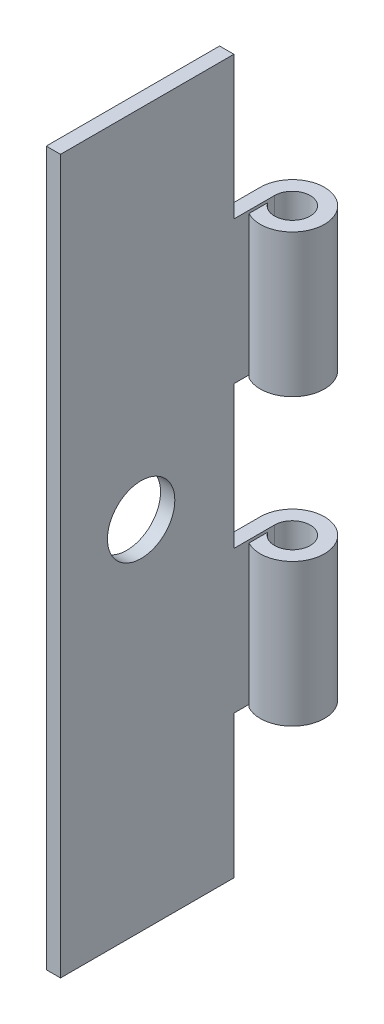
ISO-10303-21;
HEADER;
FILE_DESCRIPTION(('STEP AP214'),'2;1');
FILE_NAME('part.step','',(''),(''),'','','');
FILE_SCHEMA(('AUTOMOTIVE_DESIGN { 1 0 10303 214 1 1 1 1 }'));
ENDSEC;
DATA;
#1=APPLICATION_CONTEXT('core data for automotive mechanical design processes');
#2=APPLICATION_PROTOCOL_DEFINITION('international standard','automotive_design',2000,#1);
#3=PRODUCT_CONTEXT('',#1,'mechanical');
#4=PRODUCT('Part','Part','',(#3));
#5=PRODUCT_RELATED_PRODUCT_CATEGORY('part','',(#4));
#6=PRODUCT_DEFINITION_FORMATION('','',#4);
#7=PRODUCT_DEFINITION_CONTEXT('part definition',#1,'design');
#8=PRODUCT_DEFINITION('design','',#6,#7);
#9=PRODUCT_DEFINITION_SHAPE('','',#8);
#10=(LENGTH_UNIT() NAMED_UNIT(*) SI_UNIT(.MILLI.,.METRE.));
#11=(NAMED_UNIT(*) PLANE_ANGLE_UNIT() SI_UNIT($,.RADIAN.));
#12=(NAMED_UNIT(*) SI_UNIT($,.STERADIAN.) SOLID_ANGLE_UNIT());
#13=UNCERTAINTY_MEASURE_WITH_UNIT(LENGTH_MEASURE(1.E-05),#10,'distance_accuracy_value','');
#14=(GEOMETRIC_REPRESENTATION_CONTEXT(3) GLOBAL_UNCERTAINTY_ASSIGNED_CONTEXT((#13)) GLOBAL_UNIT_ASSIGNED_CONTEXT((#10,
#11,#12)) REPRESENTATION_CONTEXT('',''));
#15=CARTESIAN_POINT('',(0.,0.,0.));
#16=DIRECTION('',(0.,0.,1.));
#17=DIRECTION('',(1.,0.,0.));
#18=AXIS2_PLACEMENT_3D('',#15,#16,#17);
#19=CARTESIAN_POINT('',(1.42875,31.75,0.));
#20=DIRECTION('',(0.,-1.,0.));
#21=DIRECTION('',(0.,0.,-1.));
#22=AXIS2_PLACEMENT_3D('',#19,#20,#21);
#23=CYLINDRICAL_SURFACE('',#22,1.42875);
#24=DIRECTION('',(0.,-1.,0.));
#25=VECTOR('',#24,1.);
#26=CARTESIAN_POINT('',(0.762000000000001,31.75,1.26363404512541));
#27=LINE('',#26,#25);
#28=CARTESIAN_POINT('',(0.762000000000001,12.7,1.26363404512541));
#29=VERTEX_POINT('',#28);
#30=CARTESIAN_POINT('',(0.762000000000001,6.35,1.26363404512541));
#31=VERTEX_POINT('',#30);
#32=EDGE_CURVE('E199',#29,#31,#27,.T.);
#33=ORIENTED_EDGE('',*,*,#32,.T.);
#34=CARTESIAN_POINT('',(1.42875,6.35,0.));
#35=DIRECTION('',(0.,-1.,0.));
#36=DIRECTION('',(0.,0.,-1.));
#37=AXIS2_PLACEMENT_3D('',#34,#35,#36);
#38=CIRCLE('',#37,1.42875);
#39=CARTESIAN_POINT('',(0.,6.35,0.));
#40=VERTEX_POINT('',#39);
#41=EDGE_CURVE('E187',#40,#31,#38,.T.);
#42=ORIENTED_EDGE('',*,*,#41,.F.);
#43=DIRECTION('',(0.,-1.,0.));
#44=VECTOR('',#43,1.);
#45=CARTESIAN_POINT('',(0.,31.75,0.));
#46=LINE('',#45,#44);
#47=CARTESIAN_POINT('',(0.,12.7,0.));
#48=VERTEX_POINT('',#47);
#49=EDGE_CURVE('E216',#48,#40,#46,.T.);
#50=ORIENTED_EDGE('',*,*,#49,.F.);
#51=CARTESIAN_POINT('',(1.42875,12.7,0.));
#52=DIRECTION('',(0.,1.,0.));
#53=DIRECTION('',(0.,0.,1.));
#54=AXIS2_PLACEMENT_3D('',#51,#52,#53);
#55=CIRCLE('',#54,1.42875);
#56=EDGE_CURVE('E247',#29,#48,#55,.T.);
#57=ORIENTED_EDGE('',*,*,#56,.F.);
#58=EDGE_LOOP('',(#33,#42,#50,#57));
#59=FACE_BOUND('',#58,.T.);
#60=ADVANCED_FACE('F49',(#59),#23,.T.);
#61=CARTESIAN_POINT('',(1.42875,25.4,0.));
#62=DIRECTION('',(0.,1.,0.));
#63=DIRECTION('',(0.,0.,1.));
#64=AXIS2_PLACEMENT_3D('',#61,#62,#63);
#65=CIRCLE('',#64,1.42875);
#66=CARTESIAN_POINT('',(0.762000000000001,25.4,1.26363404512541));
#67=VERTEX_POINT('',#66);
#68=CARTESIAN_POINT('',(0.,25.4,0.));
#69=VERTEX_POINT('',#68);
#70=EDGE_CURVE('E240',#67,#69,#65,.T.);
#71=ORIENTED_EDGE('',*,*,#70,.F.);
#72=CARTESIAN_POINT('',(0.762000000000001,19.05,1.26363404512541));
#73=VERTEX_POINT('',#72);
#74=EDGE_CURVE('E202',#67,#73,#27,.T.);
#75=ORIENTED_EDGE('',*,*,#74,.T.);
#76=CARTESIAN_POINT('',(1.42875,19.05,0.));
#77=DIRECTION('',(0.,-1.,0.));
#78=DIRECTION('',(0.,0.,-1.));
#79=AXIS2_PLACEMENT_3D('',#76,#77,#78);
#80=CIRCLE('',#79,1.42875);
#81=CARTESIAN_POINT('',(0.,19.05,0.));
#82=VERTEX_POINT('',#81);
#83=EDGE_CURVE('E63',#82,#73,#80,.T.);
#84=ORIENTED_EDGE('',*,*,#83,.F.);
#85=EDGE_CURVE('E173',#69,#82,#46,.T.);
#86=ORIENTED_EDGE('',*,*,#85,.F.);
#87=EDGE_LOOP('',(#71,#75,#84,#86));
#88=FACE_BOUND('',#87,.T.);
#89=ADVANCED_FACE('F320',(#88),#23,.T.);
#90=CARTESIAN_POINT('',(0.,31.75,0.));
#91=DIRECTION('',(1.,0.,0.));
#92=DIRECTION('',(0.,0.,-1.));
#93=AXIS2_PLACEMENT_3D('',#90,#91,#92);
#94=PLANE('',#93);
#95=CARTESIAN_POINT('',(0.,15.875,5.93725));
#96=DIRECTION('',(1.,0.,0.));
#97=DIRECTION('',(0.,0.,-1.));
#98=AXIS2_PLACEMENT_3D('',#95,#96,#97);
#99=CIRCLE('',#98,1.5);
#100=CARTESIAN_POINT('',(0.,15.875,4.43725));
#101=VERTEX_POINT('',#100);
#102=EDGE_CURVE('E313',#101,#101,#99,.T.);
#103=ORIENTED_EDGE('',*,*,#102,.T.);
#104=EDGE_LOOP('',(#103));
#105=FACE_BOUND('',#104,.T.);
#106=DIRECTION('',(0.,-1.,0.));
#107=VECTOR('',#106,1.);
#108=CARTESIAN_POINT('',(0.,6.35,1.80975));
#109=LINE('',#108,#107);
#110=CARTESIAN_POINT('',(0.,6.35,1.80975));
#111=VERTEX_POINT('',#110);
#112=CARTESIAN_POINT('',(0.,0.,1.80975));
#113=VERTEX_POINT('',#112);
#114=EDGE_CURVE('E164',#111,#113,#109,.T.);
#115=ORIENTED_EDGE('',*,*,#114,.T.);
#116=DIRECTION('',(0.,0.,1.));
#117=VECTOR('',#116,1.);
#118=CARTESIAN_POINT('',(0.,0.,0.));
#119=LINE('',#118,#117);
#120=CARTESIAN_POINT('',(0.,0.,9.525));
#121=VERTEX_POINT('',#120);
#122=EDGE_CURVE('E178',#113,#121,#119,.T.);
#123=ORIENTED_EDGE('',*,*,#122,.T.);
#124=DIRECTION('',(0.,-1.,0.));
#125=VECTOR('',#124,1.);
#126=CARTESIAN_POINT('',(0.,31.75,9.525));
#127=LINE('',#126,#125);
#128=CARTESIAN_POINT('',(0.,31.75,9.525));
#129=VERTEX_POINT('',#128);
#130=EDGE_CURVE('E214',#129,#121,#127,.T.);
#131=ORIENTED_EDGE('',*,*,#130,.F.);
#132=DIRECTION('',(0.,0.,1.));
#133=VECTOR('',#132,1.);
#134=CARTESIAN_POINT('',(0.,31.75,0.));
#135=LINE('',#134,#133);
#136=CARTESIAN_POINT('',(0.,31.75,1.80975));
#137=VERTEX_POINT('',#136);
#138=EDGE_CURVE('E198',#137,#129,#135,.T.);
#139=ORIENTED_EDGE('',*,*,#138,.F.);
#140=DIRECTION('',(0.,-1.,0.));
#141=VECTOR('',#140,1.);
#142=CARTESIAN_POINT('',(0.,31.75,1.80975));
#143=LINE('',#142,#141);
#144=CARTESIAN_POINT('',(0.,25.4,1.80975));
#145=VERTEX_POINT('',#144);
#146=EDGE_CURVE('E71',#137,#145,#143,.T.);
#147=ORIENTED_EDGE('',*,*,#146,.T.);
#148=DIRECTION('',(0.,0.,-1.));
#149=VECTOR('',#148,1.);
#150=CARTESIAN_POINT('',(0.,25.4,1.80975));
#151=LINE('',#150,#149);
#152=EDGE_CURVE('E307',#145,#69,#151,.T.);
#153=ORIENTED_EDGE('',*,*,#152,.T.);
#154=ORIENTED_EDGE('',*,*,#85,.T.);
#155=DIRECTION('',(0.,0.,1.));
#156=VECTOR('',#155,1.);
#157=CARTESIAN_POINT('',(0.,19.05,1.80975));
#158=LINE('',#157,#156);
#159=CARTESIAN_POINT('',(0.,19.05,1.80975));
#160=VERTEX_POINT('',#159);
#161=EDGE_CURVE('E301',#82,#160,#158,.T.);
#162=ORIENTED_EDGE('',*,*,#161,.T.);
#163=DIRECTION('',(0.,-1.,0.));
#164=VECTOR('',#163,1.);
#165=CARTESIAN_POINT('',(0.,19.05,1.80975));
#166=LINE('',#165,#164);
#167=CARTESIAN_POINT('',(0.,12.7,1.80975));
#168=VERTEX_POINT('',#167);
#169=EDGE_CURVE('E298',#160,#168,#166,.T.);
#170=ORIENTED_EDGE('',*,*,#169,.T.);
#171=DIRECTION('',(0.,0.,-1.));
#172=VECTOR('',#171,1.);
#173=CARTESIAN_POINT('',(0.,12.7,1.80975));
#174=LINE('',#173,#172);
#175=EDGE_CURVE('E312',#168,#48,#174,.T.);
#176=ORIENTED_EDGE('',*,*,#175,.T.);
#177=ORIENTED_EDGE('',*,*,#49,.T.);
#178=DIRECTION('',(0.,0.,1.));
#179=VECTOR('',#178,1.);
#180=CARTESIAN_POINT('',(0.,6.35,1.80975));
#181=LINE('',#180,#179);
#182=EDGE_CURVE('E181',#40,#111,#181,.T.);
#183=ORIENTED_EDGE('',*,*,#182,.T.);
#184=EDGE_LOOP('',(#115,#123,#131,#139,#147,#153,#154,#162,#170,#176,#177,#183));
#185=FACE_BOUND('',#184,.T.);
#186=ADVANCED_FACE('F176',(#105,#185),#94,.F.);
#187=CARTESIAN_POINT('',(0.635,31.75,9.525));
#188=DIRECTION('',(-1.,0.,0.));
#189=DIRECTION('',(0.,0.,1.));
#190=AXIS2_PLACEMENT_3D('',#187,#188,#189);
#191=PLANE('',#190);
#192=CARTESIAN_POINT('',(0.635,15.875,5.93725));
#193=DIRECTION('',(1.,0.,0.));
#194=DIRECTION('',(0.,0.,-1.));
#195=AXIS2_PLACEMENT_3D('',#192,#193,#194);
#196=CIRCLE('',#195,1.5);
#197=CARTESIAN_POINT('',(0.635,15.875,4.43725));
#198=VERTEX_POINT('',#197);
#199=EDGE_CURVE('E550',#198,#198,#196,.T.);
#200=ORIENTED_EDGE('',*,*,#199,.F.);
#201=EDGE_LOOP('',(#200));
#202=FACE_BOUND('',#201,.T.);
#203=DIRECTION('',(0.,-1.,0.));
#204=VECTOR('',#203,1.);
#205=CARTESIAN_POINT('',(0.635,31.75,1.80974999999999));
#206=LINE('',#205,#204);
#207=CARTESIAN_POINT('',(0.635000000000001,6.35,1.80975));
#208=VERTEX_POINT('',#207);
#209=CARTESIAN_POINT('',(0.635,0.,1.80975));
#210=VERTEX_POINT('',#209);
#211=EDGE_CURVE('E167',#208,#210,#206,.T.);
#212=ORIENTED_EDGE('',*,*,#211,.F.);
#213=DIRECTION('',(0.,0.,1.));
#214=VECTOR('',#213,1.);
#215=CARTESIAN_POINT('',(0.635,6.35,9.525));
#216=LINE('',#215,#214);
#217=CARTESIAN_POINT('',(0.635,6.35,0.));
#218=VERTEX_POINT('',#217);
#219=EDGE_CURVE('E191',#218,#208,#216,.T.);
#220=ORIENTED_EDGE('',*,*,#219,.F.);
#221=DIRECTION('',(0.,-1.,0.));
#222=VECTOR('',#221,1.);
#223=CARTESIAN_POINT('',(0.635,31.75,0.));
#224=LINE('',#223,#222);
#225=CARTESIAN_POINT('',(0.635,12.7,0.));
#226=VERTEX_POINT('',#225);
#227=EDGE_CURVE('E207',#226,#218,#224,.T.);
#228=ORIENTED_EDGE('',*,*,#227,.F.);
#229=DIRECTION('',(0.,0.,-1.));
#230=VECTOR('',#229,1.);
#231=CARTESIAN_POINT('',(0.635,12.7,9.525));
#232=LINE('',#231,#230);
#233=CARTESIAN_POINT('',(0.635000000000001,12.7,1.80975));
#234=VERTEX_POINT('',#233);
#235=EDGE_CURVE('E252',#234,#226,#232,.T.);
#236=ORIENTED_EDGE('',*,*,#235,.F.);
#237=DIRECTION('',(0.,-1.,0.));
#238=VECTOR('',#237,1.);
#239=CARTESIAN_POINT('',(0.635,31.75,1.80975));
#240=LINE('',#239,#238);
#241=CARTESIAN_POINT('',(0.635000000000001,19.05,1.80975));
#242=VERTEX_POINT('',#241);
#243=EDGE_CURVE('E12',#242,#234,#240,.T.);
#244=ORIENTED_EDGE('',*,*,#243,.F.);
#245=DIRECTION('',(0.,0.,1.));
#246=VECTOR('',#245,1.);
#247=CARTESIAN_POINT('',(0.635,19.05,9.525));
#248=LINE('',#247,#246);
#249=CARTESIAN_POINT('',(0.635,19.05,0.));
#250=VERTEX_POINT('',#249);
#251=EDGE_CURVE('E255',#250,#242,#248,.T.);
#252=ORIENTED_EDGE('',*,*,#251,.F.);
#253=CARTESIAN_POINT('',(0.635,25.4,0.));
#254=VERTEX_POINT('',#253);
#255=EDGE_CURVE('E210',#254,#250,#224,.T.);
#256=ORIENTED_EDGE('',*,*,#255,.F.);
#257=DIRECTION('',(0.,0.,-1.));
#258=VECTOR('',#257,1.);
#259=CARTESIAN_POINT('',(0.635,25.4,9.525));
#260=LINE('',#259,#258);
#261=CARTESIAN_POINT('',(0.635000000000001,25.4,1.80975));
#262=VERTEX_POINT('',#261);
#263=EDGE_CURVE('E262',#262,#254,#260,.T.);
#264=ORIENTED_EDGE('',*,*,#263,.F.);
#265=DIRECTION('',(0.,-1.,0.));
#266=VECTOR('',#265,1.);
#267=CARTESIAN_POINT('',(0.635,31.75,1.80975));
#268=LINE('',#267,#266);
#269=CARTESIAN_POINT('',(0.635000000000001,31.75,1.80975));
#270=VERTEX_POINT('',#269);
#271=EDGE_CURVE('E278',#270,#262,#268,.T.);
#272=ORIENTED_EDGE('',*,*,#271,.F.);
#273=DIRECTION('',(0.,0.,-1.));
#274=VECTOR('',#273,1.);
#275=CARTESIAN_POINT('',(0.635,31.75,9.525));
#276=LINE('',#275,#274);
#277=CARTESIAN_POINT('',(0.635,31.75,9.525));
#278=VERTEX_POINT('',#277);
#279=EDGE_CURVE('E194',#278,#270,#276,.T.);
#280=ORIENTED_EDGE('',*,*,#279,.F.);
#281=DIRECTION('',(0.,-1.,0.));
#282=VECTOR('',#281,1.);
#283=CARTESIAN_POINT('',(0.635,31.75,9.525));
#284=LINE('',#283,#282);
#285=CARTESIAN_POINT('',(0.635,0.,9.525));
#286=VERTEX_POINT('',#285);
#287=EDGE_CURVE('E211',#278,#286,#284,.T.);
#288=ORIENTED_EDGE('',*,*,#287,.T.);
#289=DIRECTION('',(0.,0.,-1.));
#290=VECTOR('',#289,1.);
#291=CARTESIAN_POINT('',(0.635,0.,9.525));
#292=LINE('',#291,#290);
#293=EDGE_CURVE('E189',#286,#210,#292,.T.);
#294=ORIENTED_EDGE('',*,*,#293,.T.);
#295=EDGE_LOOP('',(#212,#220,#228,#236,#244,#252,#256,#264,#272,#280,#288,#294));
#296=FACE_BOUND('',#295,.T.);
#297=ADVANCED_FACE('F276',(#202,#296),#191,.F.);
#298=CARTESIAN_POINT('',(1.42875,31.75,0.));
#299=DIRECTION('',(0.,-1.,0.));
#300=DIRECTION('',(0.,0.,-1.));
#301=AXIS2_PLACEMENT_3D('',#298,#299,#300);
#302=CYLINDRICAL_SURFACE('',#301,0.79375);
#303=CARTESIAN_POINT('',(1.42875,6.35,0.));
#304=DIRECTION('',(0.,-1.,0.));
#305=DIRECTION('',(0.,0.,-1.));
#306=AXIS2_PLACEMENT_3D('',#303,#304,#305);
#307=CIRCLE('',#306,0.79375);
#308=CARTESIAN_POINT('',(0.762000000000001,6.35,0.430677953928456));
#309=VERTEX_POINT('',#308);
#310=EDGE_CURVE('E230',#309,#218,#307,.F.);
#311=ORIENTED_EDGE('',*,*,#310,.F.);
#312=DIRECTION('',(0.,-1.,0.));
#313=VECTOR('',#312,1.);
#314=CARTESIAN_POINT('',(0.762000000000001,31.75,0.430677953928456));
#315=LINE('',#314,#313);
#316=CARTESIAN_POINT('',(0.762000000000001,12.7,0.430677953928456));
#317=VERTEX_POINT('',#316);
#318=EDGE_CURVE('E203',#317,#309,#315,.T.);
#319=ORIENTED_EDGE('',*,*,#318,.F.);
#320=CARTESIAN_POINT('',(1.42875,12.7,0.));
#321=DIRECTION('',(0.,1.,0.));
#322=DIRECTION('',(0.,0.,1.));
#323=AXIS2_PLACEMENT_3D('',#320,#321,#322);
#324=CIRCLE('',#323,0.79375);
#325=EDGE_CURVE('E249',#226,#317,#324,.F.);
#326=ORIENTED_EDGE('',*,*,#325,.F.);
#327=ORIENTED_EDGE('',*,*,#227,.T.);
#328=EDGE_LOOP('',(#311,#319,#326,#327));
#329=FACE_BOUND('',#328,.T.);
#330=ADVANCED_FACE('F237',(#329),#302,.F.);
#331=CARTESIAN_POINT('',(1.42875,25.4,0.));
#332=DIRECTION('',(0.,1.,0.));
#333=DIRECTION('',(0.,0.,1.));
#334=AXIS2_PLACEMENT_3D('',#331,#332,#333);
#335=CIRCLE('',#334,0.79375);
#336=CARTESIAN_POINT('',(0.762000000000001,25.4,0.430677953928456));
#337=VERTEX_POINT('',#336);
#338=EDGE_CURVE('E260',#254,#337,#335,.F.);
#339=ORIENTED_EDGE('',*,*,#338,.F.);
#340=ORIENTED_EDGE('',*,*,#255,.T.);
#341=CARTESIAN_POINT('',(1.42875,19.05,0.));
#342=DIRECTION('',(0.,-1.,0.));
#343=DIRECTION('',(0.,0.,-1.));
#344=AXIS2_PLACEMENT_3D('',#341,#342,#343);
#345=CIRCLE('',#344,0.79375);
#346=CARTESIAN_POINT('',(0.762000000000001,19.05,0.430677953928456));
#347=VERTEX_POINT('',#346);
#348=EDGE_CURVE('E281',#347,#250,#345,.F.);
#349=ORIENTED_EDGE('',*,*,#348,.F.);
#350=EDGE_CURVE('E206',#337,#347,#315,.T.);
#351=ORIENTED_EDGE('',*,*,#350,.F.);
#352=EDGE_LOOP('',(#339,#340,#349,#351));
#353=FACE_BOUND('',#352,.T.);
#354=ADVANCED_FACE('F329',(#353),#302,.F.);
#355=CARTESIAN_POINT('',(0.762000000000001,31.75,0.430677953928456));
#356=DIRECTION('',(1.,0.,0.));
#357=DIRECTION('',(0.,0.,-1.));
#358=AXIS2_PLACEMENT_3D('',#355,#356,#357);
#359=PLANE('',#358);
#360=DIRECTION('',(0.,0.,-1.));
#361=VECTOR('',#360,1.);
#362=CARTESIAN_POINT('',(0.762000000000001,6.35,0.430677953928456));
#363=LINE('',#362,#361);
#364=EDGE_CURVE('E56',#31,#309,#363,.T.);
#365=ORIENTED_EDGE('',*,*,#364,.F.);
#366=ORIENTED_EDGE('',*,*,#32,.F.);
#367=DIRECTION('',(0.,0.,1.));
#368=VECTOR('',#367,1.);
#369=CARTESIAN_POINT('',(0.762000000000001,12.7,0.430677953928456));
#370=LINE('',#369,#368);
#371=EDGE_CURVE('E221',#317,#29,#370,.T.);
#372=ORIENTED_EDGE('',*,*,#371,.F.);
#373=ORIENTED_EDGE('',*,*,#318,.T.);
#374=EDGE_LOOP('',(#365,#366,#372,#373));
#375=FACE_BOUND('',#374,.T.);
#376=ADVANCED_FACE('F243',(#375),#359,.F.);
#377=DIRECTION('',(0.,0.,1.));
#378=VECTOR('',#377,1.);
#379=CARTESIAN_POINT('',(0.762000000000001,25.4,0.430677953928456));
#380=LINE('',#379,#378);
#381=EDGE_CURVE('E224',#337,#67,#380,.T.);
#382=ORIENTED_EDGE('',*,*,#381,.F.);
#383=ORIENTED_EDGE('',*,*,#350,.T.);
#384=DIRECTION('',(0.,0.,-1.));
#385=VECTOR('',#384,1.);
#386=CARTESIAN_POINT('',(0.762000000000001,19.05,0.430677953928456));
#387=LINE('',#386,#385);
#388=EDGE_CURVE('E219',#73,#347,#387,.T.);
#389=ORIENTED_EDGE('',*,*,#388,.F.);
#390=ORIENTED_EDGE('',*,*,#74,.F.);
#391=EDGE_LOOP('',(#382,#383,#389,#390));
#392=FACE_BOUND('',#391,.T.);
#393=ADVANCED_FACE('F324',(#392),#359,.F.);
#394=CARTESIAN_POINT('',(1.42875,31.75,0.));
#395=DIRECTION('',(0.,1.,0.));
#396=DIRECTION('',(0.,0.,1.));
#397=AXIS2_PLACEMENT_3D('',#394,#395,#396);
#398=PLANE('',#397);
#399=ORIENTED_EDGE('',*,*,#279,.T.);
#400=DIRECTION('',(-1.,0.,0.));
#401=VECTOR('',#400,1.);
#402=CARTESIAN_POINT('',(1.42875,31.75,1.80975));
#403=LINE('',#402,#401);
#404=EDGE_CURVE('E172',#270,#137,#403,.T.);
#405=ORIENTED_EDGE('',*,*,#404,.T.);
#406=ORIENTED_EDGE('',*,*,#138,.T.);
#407=DIRECTION('',(1.,0.,0.));
#408=VECTOR('',#407,1.);
#409=CARTESIAN_POINT('',(0.,31.75,9.525));
#410=LINE('',#409,#408);
#411=EDGE_CURVE('E266',#129,#278,#410,.T.);
#412=ORIENTED_EDGE('',*,*,#411,.T.);
#413=EDGE_LOOP('',(#399,#405,#406,#412));
#414=FACE_BOUND('',#413,.T.);
#415=ADVANCED_FACE('F272',(#414),#398,.T.);
#416=CARTESIAN_POINT('',(1.42875,0.,0.));
#417=DIRECTION('',(0.,1.,0.));
#418=DIRECTION('',(0.,0.,1.));
#419=AXIS2_PLACEMENT_3D('',#416,#417,#418);
#420=PLANE('',#419);
#421=DIRECTION('',(-1.,0.,0.));
#422=VECTOR('',#421,1.);
#423=CARTESIAN_POINT('',(1.42875,0.,1.80975));
#424=LINE('',#423,#422);
#425=EDGE_CURVE('E160',#210,#113,#424,.T.);
#426=ORIENTED_EDGE('',*,*,#425,.F.);
#427=ORIENTED_EDGE('',*,*,#293,.F.);
#428=DIRECTION('',(1.,0.,0.));
#429=VECTOR('',#428,1.);
#430=CARTESIAN_POINT('',(0.,0.,9.525));
#431=LINE('',#430,#429);
#432=EDGE_CURVE('E186',#121,#286,#431,.T.);
#433=ORIENTED_EDGE('',*,*,#432,.F.);
#434=ORIENTED_EDGE('',*,*,#122,.F.);
#435=EDGE_LOOP('',(#426,#427,#433,#434));
#436=FACE_BOUND('',#435,.T.);
#437=ADVANCED_FACE('F185',(#436),#420,.F.);
#438=CARTESIAN_POINT('',(0.,31.75,9.525));
#439=DIRECTION('',(0.,0.,-1.));
#440=DIRECTION('',(-1.,0.,0.));
#441=AXIS2_PLACEMENT_3D('',#438,#439,#440);
#442=PLANE('',#441);
#443=ORIENTED_EDGE('',*,*,#432,.T.);
#444=ORIENTED_EDGE('',*,*,#287,.F.);
#445=ORIENTED_EDGE('',*,*,#411,.F.);
#446=ORIENTED_EDGE('',*,*,#130,.T.);
#447=EDGE_LOOP('',(#443,#444,#445,#446));
#448=FACE_BOUND('',#447,.T.);
#449=ADVANCED_FACE('F359',(#448),#442,.F.);
#450=CARTESIAN_POINT('',(2.8575,6.35,1.80975));
#451=DIRECTION('',(0.,-1.,0.));
#452=DIRECTION('',(0.,0.,-1.));
#453=AXIS2_PLACEMENT_3D('',#450,#451,#452);
#454=PLANE('',#453);
#455=ORIENTED_EDGE('',*,*,#41,.T.);
#456=ORIENTED_EDGE('',*,*,#364,.T.);
#457=ORIENTED_EDGE('',*,*,#310,.T.);
#458=ORIENTED_EDGE('',*,*,#219,.T.);
#459=DIRECTION('',(-1.,0.,0.));
#460=VECTOR('',#459,1.);
#461=CARTESIAN_POINT('',(2.8575,6.35,1.80975));
#462=LINE('',#461,#460);
#463=EDGE_CURVE('E284',#208,#111,#462,.T.);
#464=ORIENTED_EDGE('',*,*,#463,.T.);
#465=ORIENTED_EDGE('',*,*,#182,.F.);
#466=EDGE_LOOP('',(#455,#456,#457,#458,#464,#465));
#467=FACE_BOUND('',#466,.T.);
#468=ADVANCED_FACE('F229',(#467),#454,.T.);
#469=CARTESIAN_POINT('',(2.8575,6.35,1.80975));
#470=DIRECTION('',(0.,0.,-1.));
#471=DIRECTION('',(0.,1.,0.));
#472=AXIS2_PLACEMENT_3D('',#469,#470,#471);
#473=PLANE('',#472);
#474=ORIENTED_EDGE('',*,*,#211,.T.);
#475=ORIENTED_EDGE('',*,*,#425,.T.);
#476=ORIENTED_EDGE('',*,*,#114,.F.);
#477=ORIENTED_EDGE('',*,*,#463,.F.);
#478=EDGE_LOOP('',(#474,#475,#476,#477));
#479=FACE_BOUND('',#478,.T.);
#480=ADVANCED_FACE('F162',(#479),#473,.T.);
#481=CARTESIAN_POINT('',(2.8575,25.4,1.80975));
#482=DIRECTION('',(0.,1.,0.));
#483=DIRECTION('',(0.,0.,1.));
#484=AXIS2_PLACEMENT_3D('',#481,#482,#483);
#485=PLANE('',#484);
#486=ORIENTED_EDGE('',*,*,#70,.T.);
#487=ORIENTED_EDGE('',*,*,#152,.F.);
#488=DIRECTION('',(-1.,0.,0.));
#489=VECTOR('',#488,1.);
#490=CARTESIAN_POINT('',(2.8575,25.4,1.80975));
#491=LINE('',#490,#489);
#492=EDGE_CURVE('E182',#262,#145,#491,.T.);
#493=ORIENTED_EDGE('',*,*,#492,.F.);
#494=ORIENTED_EDGE('',*,*,#263,.T.);
#495=ORIENTED_EDGE('',*,*,#338,.T.);
#496=ORIENTED_EDGE('',*,*,#381,.T.);
#497=EDGE_LOOP('',(#486,#487,#493,#494,#495,#496));
#498=FACE_BOUND('',#497,.T.);
#499=ADVANCED_FACE('F331',(#498),#485,.T.);
#500=CARTESIAN_POINT('',(2.8575,31.75,1.80975));
#501=DIRECTION('',(0.,0.,-1.));
#502=DIRECTION('',(0.,1.,0.));
#503=AXIS2_PLACEMENT_3D('',#500,#501,#502);
#504=PLANE('',#503);
#505=ORIENTED_EDGE('',*,*,#271,.T.);
#506=ORIENTED_EDGE('',*,*,#492,.T.);
#507=ORIENTED_EDGE('',*,*,#146,.F.);
#508=ORIENTED_EDGE('',*,*,#404,.F.);
#509=EDGE_LOOP('',(#505,#506,#507,#508));
#510=FACE_BOUND('',#509,.T.);
#511=ADVANCED_FACE('F333',(#510),#504,.T.);
#512=CARTESIAN_POINT('',(2.8575,19.05,1.80975));
#513=DIRECTION('',(0.,0.,-1.));
#514=DIRECTION('',(0.,1.,0.));
#515=AXIS2_PLACEMENT_3D('',#512,#513,#514);
#516=PLANE('',#515);
#517=ORIENTED_EDGE('',*,*,#243,.T.);
#518=DIRECTION('',(-1.,0.,0.));
#519=VECTOR('',#518,1.);
#520=CARTESIAN_POINT('',(2.8575,12.7,1.80975));
#521=LINE('',#520,#519);
#522=EDGE_CURVE('E300',#234,#168,#521,.T.);
#523=ORIENTED_EDGE('',*,*,#522,.T.);
#524=ORIENTED_EDGE('',*,*,#169,.F.);
#525=DIRECTION('',(-1.,0.,0.));
#526=VECTOR('',#525,1.);
#527=CARTESIAN_POINT('',(2.8575,19.05,1.80975));
#528=LINE('',#527,#526);
#529=EDGE_CURVE('E290',#242,#160,#528,.T.);
#530=ORIENTED_EDGE('',*,*,#529,.F.);
#531=EDGE_LOOP('',(#517,#523,#524,#530));
#532=FACE_BOUND('',#531,.T.);
#533=ADVANCED_FACE('F296',(#532),#516,.T.);
#534=CARTESIAN_POINT('',(2.8575,12.7,1.80975));
#535=DIRECTION('',(0.,1.,0.));
#536=DIRECTION('',(0.,0.,1.));
#537=AXIS2_PLACEMENT_3D('',#534,#535,#536);
#538=PLANE('',#537);
#539=ORIENTED_EDGE('',*,*,#56,.T.);
#540=ORIENTED_EDGE('',*,*,#175,.F.);
#541=ORIENTED_EDGE('',*,*,#522,.F.);
#542=ORIENTED_EDGE('',*,*,#235,.T.);
#543=ORIENTED_EDGE('',*,*,#325,.T.);
#544=ORIENTED_EDGE('',*,*,#371,.T.);
#545=EDGE_LOOP('',(#539,#540,#541,#542,#543,#544));
#546=FACE_BOUND('',#545,.T.);
#547=ADVANCED_FACE('F245',(#546),#538,.T.);
#548=CARTESIAN_POINT('',(2.8575,19.05,1.80975));
#549=DIRECTION('',(0.,-1.,0.));
#550=DIRECTION('',(0.,0.,-1.));
#551=AXIS2_PLACEMENT_3D('',#548,#549,#550);
#552=PLANE('',#551);
#553=ORIENTED_EDGE('',*,*,#83,.T.);
#554=ORIENTED_EDGE('',*,*,#388,.T.);
#555=ORIENTED_EDGE('',*,*,#348,.T.);
#556=ORIENTED_EDGE('',*,*,#251,.T.);
#557=ORIENTED_EDGE('',*,*,#529,.T.);
#558=ORIENTED_EDGE('',*,*,#161,.F.);
#559=EDGE_LOOP('',(#553,#554,#555,#556,#557,#558));
#560=FACE_BOUND('',#559,.T.);
#561=ADVANCED_FACE('F289',(#560),#552,.T.);
#562=CARTESIAN_POINT('',(0.,15.875,5.93725));
#563=DIRECTION('',(1.,0.,0.));
#564=DIRECTION('',(0.,0.,-1.));
#565=AXIS2_PLACEMENT_3D('',#562,#563,#564);
#566=CYLINDRICAL_SURFACE('',#565,1.5);
#567=ORIENTED_EDGE('',*,*,#102,.F.);
#568=EDGE_LOOP('',(#567));
#569=FACE_BOUND('',#568,.T.);
#570=ORIENTED_EDGE('',*,*,#199,.T.);
#571=EDGE_LOOP('',(#570));
#572=FACE_BOUND('',#571,.T.);
#573=ADVANCED_FACE('F373',(#569,#572),#566,.F.);
#574=CLOSED_SHELL('',(#60,#89,#186,#297,#330,#354,#376,#393,#415,#437,#449,#468,#480,#499,#511,
#533,#547,#561,#573));
#575=MANIFOLD_SOLID_BREP('B2',#574);
#576=ADVANCED_BREP_SHAPE_REPRESENTATION('',(#18,#575),#14);
#577=SHAPE_DEFINITION_REPRESENTATION(#9,#576);
ENDSEC;
END-ISO-10303-21;
